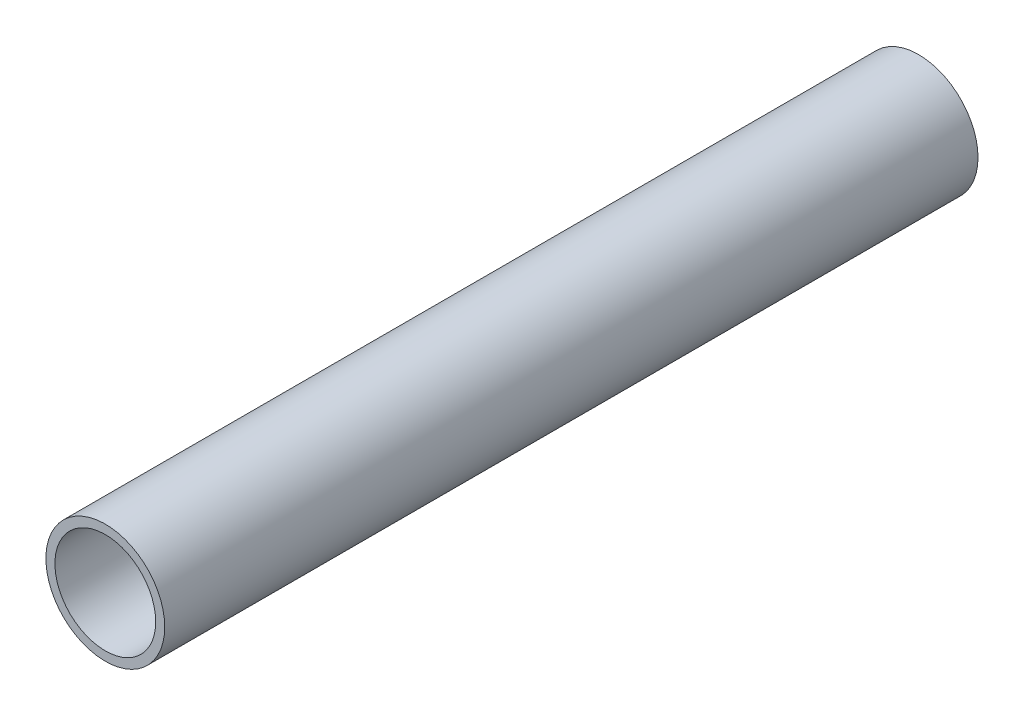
ISO-10303-21;
HEADER;
FILE_DESCRIPTION(('STEP AP214'),'2;1');
FILE_NAME('part.step','',(''),(''),'','','');
FILE_SCHEMA(('AUTOMOTIVE_DESIGN { 1 0 10303 214 1 1 1 1 }'));
ENDSEC;
DATA;
#1=APPLICATION_CONTEXT('core data for automotive mechanical design processes');
#2=APPLICATION_PROTOCOL_DEFINITION('international standard','automotive_design',2000,#1);
#3=PRODUCT_CONTEXT('',#1,'mechanical');
#4=PRODUCT('Part','Part','',(#3));
#5=PRODUCT_RELATED_PRODUCT_CATEGORY('part','',(#4));
#6=PRODUCT_DEFINITION_FORMATION('','',#4);
#7=PRODUCT_DEFINITION_CONTEXT('part definition',#1,'design');
#8=PRODUCT_DEFINITION('design','',#6,#7);
#9=PRODUCT_DEFINITION_SHAPE('','',#8);
#10=(LENGTH_UNIT() NAMED_UNIT(*) SI_UNIT(.MILLI.,.METRE.));
#11=(NAMED_UNIT(*) PLANE_ANGLE_UNIT() SI_UNIT($,.RADIAN.));
#12=(NAMED_UNIT(*) SI_UNIT($,.STERADIAN.) SOLID_ANGLE_UNIT());
#13=UNCERTAINTY_MEASURE_WITH_UNIT(LENGTH_MEASURE(1.E-05),#10,'distance_accuracy_value','');
#14=(GEOMETRIC_REPRESENTATION_CONTEXT(3) GLOBAL_UNCERTAINTY_ASSIGNED_CONTEXT((#13)) GLOBAL_UNIT_ASSIGNED_CONTEXT((#10,
#11,#12)) REPRESENTATION_CONTEXT('',''));
#15=CARTESIAN_POINT('',(0.,0.,0.));
#16=DIRECTION('',(0.,0.,1.));
#17=DIRECTION('',(1.,0.,0.));
#18=AXIS2_PLACEMENT_3D('',#15,#16,#17);
#19=CARTESIAN_POINT('',(0.,0.,0.));
#20=DIRECTION('',(0.,0.,1.));
#21=DIRECTION('',(1.,0.,0.));
#22=AXIS2_PLACEMENT_3D('',#19,#20,#21);
#23=CYLINDRICAL_SURFACE('',#22,70.);
#24=CARTESIAN_POINT('',(0.,0.,0.));
#25=DIRECTION('',(0.,0.,-1.));
#26=DIRECTION('',(-1.,0.,0.));
#27=AXIS2_PLACEMENT_3D('',#24,#25,#26);
#28=CIRCLE('',#27,70.);
#29=CARTESIAN_POINT('',(70.,0.,0.));
#30=VERTEX_POINT('',#29);
#31=EDGE_CURVE('E9',#30,#30,#28,.T.);
#32=ORIENTED_EDGE('',*,*,#31,.T.);
#33=DIRECTION('',(0.,0.,1.));
#34=VECTOR('',#33,1.);
#35=CARTESIAN_POINT('',(70.,0.,565.));
#36=LINE('',#35,#34);
#37=CARTESIAN_POINT('',(70.,0.,1130.));
#38=VERTEX_POINT('',#37);
#39=EDGE_CURVE('E24',#30,#38,#36,.T.);
#40=ORIENTED_EDGE('',*,*,#39,.T.);
#41=CARTESIAN_POINT('',(0.,0.,1130.));
#42=DIRECTION('',(0.,0.,1.));
#43=DIRECTION('',(1.,0.,0.));
#44=AXIS2_PLACEMENT_3D('',#41,#42,#43);
#45=CIRCLE('',#44,70.);
#46=EDGE_CURVE('E48',#38,#38,#45,.T.);
#47=ORIENTED_EDGE('',*,*,#46,.T.);
#48=ORIENTED_EDGE('',*,*,#39,.F.);
#49=EDGE_LOOP('',(#32,#40,#47,#48));
#50=FACE_BOUND('',#49,.T.);
#51=ADVANCED_FACE('F14',(#50),#23,.F.);
#52=CARTESIAN_POINT('',(0.,0.,0.));
#53=DIRECTION('',(0.,0.,1.));
#54=DIRECTION('',(1.,0.,0.));
#55=AXIS2_PLACEMENT_3D('',#52,#53,#54);
#56=CYLINDRICAL_SURFACE('',#55,82.55);
#57=CARTESIAN_POINT('',(0.,0.,0.));
#58=DIRECTION('',(0.,0.,1.));
#59=DIRECTION('',(1.,0.,0.));
#60=AXIS2_PLACEMENT_3D('',#57,#58,#59);
#61=CIRCLE('',#60,82.55);
#62=CARTESIAN_POINT('',(82.55,0.,0.));
#63=VERTEX_POINT('',#62);
#64=EDGE_CURVE('E39',#63,#63,#61,.T.);
#65=ORIENTED_EDGE('',*,*,#64,.T.);
#66=DIRECTION('',(0.,0.,-1.));
#67=VECTOR('',#66,1.);
#68=CARTESIAN_POINT('',(82.55,0.,565.));
#69=LINE('',#68,#67);
#70=CARTESIAN_POINT('',(82.55,0.,1130.));
#71=VERTEX_POINT('',#70);
#72=EDGE_CURVE('E18',#71,#63,#69,.T.);
#73=ORIENTED_EDGE('',*,*,#72,.F.);
#74=CARTESIAN_POINT('',(0.,0.,1130.));
#75=DIRECTION('',(0.,0.,-1.));
#76=DIRECTION('',(-1.,0.,0.));
#77=AXIS2_PLACEMENT_3D('',#74,#75,#76);
#78=CIRCLE('',#77,82.55);
#79=EDGE_CURVE('E43',#71,#71,#78,.T.);
#80=ORIENTED_EDGE('',*,*,#79,.T.);
#81=ORIENTED_EDGE('',*,*,#72,.T.);
#82=EDGE_LOOP('',(#65,#73,#80,#81));
#83=FACE_BOUND('',#82,.T.);
#84=ADVANCED_FACE('F58',(#83),#56,.T.);
#85=CARTESIAN_POINT('',(86.6774916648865,-86.6774916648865,1130.));
#86=DIRECTION('',(0.,0.,1.));
#87=DIRECTION('',(0.,1.,0.));
#88=AXIS2_PLACEMENT_3D('',#85,#86,#87);
#89=PLANE('',#88);
#90=ORIENTED_EDGE('',*,*,#46,.F.);
#91=EDGE_LOOP('',(#90));
#92=FACE_BOUND('',#91,.T.);
#93=ORIENTED_EDGE('',*,*,#79,.F.);
#94=EDGE_LOOP('',(#93));
#95=FACE_BOUND('',#94,.T.);
#96=ADVANCED_FACE('F44',(#92,#95),#89,.T.);
#97=CARTESIAN_POINT('',(-86.6774916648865,86.6774916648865,0.));
#98=DIRECTION('',(0.,0.,-1.));
#99=DIRECTION('',(1.,0.,0.));
#100=AXIS2_PLACEMENT_3D('',#97,#98,#99);
#101=PLANE('',#100);
#102=ORIENTED_EDGE('',*,*,#31,.F.);
#103=EDGE_LOOP('',(#102));
#104=FACE_BOUND('',#103,.T.);
#105=ORIENTED_EDGE('',*,*,#64,.F.);
#106=EDGE_LOOP('',(#105));
#107=FACE_BOUND('',#106,.T.);
#108=ADVANCED_FACE('F16',(#104,#107),#101,.T.);
#109=CLOSED_SHELL('',(#51,#84,#96,#108));
#110=MANIFOLD_SOLID_BREP('B1',#109);
#111=ADVANCED_BREP_SHAPE_REPRESENTATION('',(#18,#110),#14);
#112=SHAPE_DEFINITION_REPRESENTATION(#9,#111);
ENDSEC;
END-ISO-10303-21;
